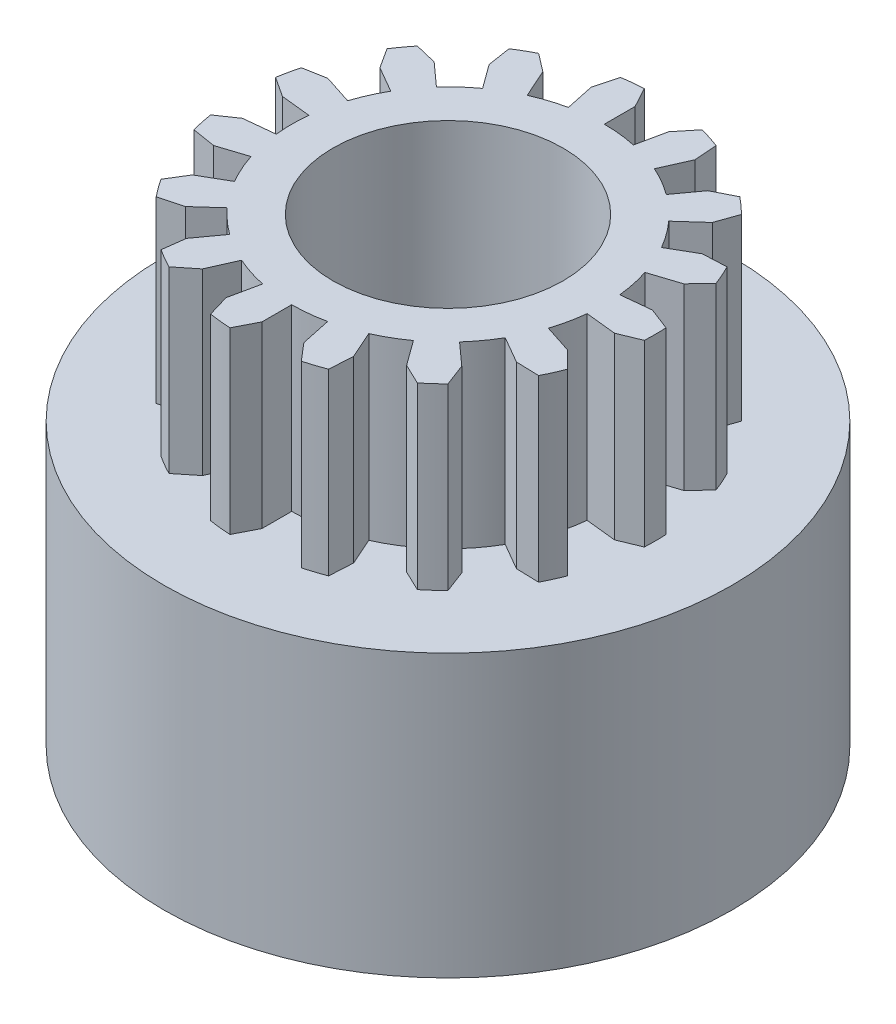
from build123d import *

# Parameters (mm, degrees)
SKETCH1_W           = 11.1125
SKETCH1_H           = 11
BOSS_EXTRUDE1_DEPTH = 7
HOLE1_D             = 9
HOLE1_CBORE_D       = 13
HOLE1_CBORE_DEPTH   = 3


with BuildPart() as part:
    # Sketch1 → Revolve1 (revolve)
    with BuildSketch(Plane.XY, mode=Mode.PRIVATE) as revolve1_sk:
        with Locations((5.55625, 5.5)):
            Rectangle(SKETCH1_W, SKETCH1_H)
    revolve(revolve1_sk.sketch.rotate(Axis((0, 11, 0), (0, -1, 0)), 270), axis=Axis((0, 11, 0), (0, -1, 0)))

    # Sketch2 → Boss-Extrude1 (add)
    with BuildSketch(Plane(origin=(0, 11, 0), x_dir=(-1, 0, 0), z_dir=(0, 1, 0))):
        with BuildLine():
            Line((-7.277131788, 0.764857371), (-6.079015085, 0.638930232))
            ThreePointArc((-6.079015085, 0.638930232), (-5.978927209, 1.27086021), (-5.813332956, 1.888866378))
            Line((-5.813332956, 1.888866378), (-6.91804243, 2.247808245))
            Line((-6.91804243, 2.247808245), (-7.57367121, 2.907259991))
            ThreePointArc((-7.57367121, 2.907259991), (-7.411137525, 3.299651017), (-7.228290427, 3.682997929))
            Line((-7.228290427, 3.682997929), (-6.33689517, 3.658608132))
            Line((-6.33689517, 3.658608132), (-5.293580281, 3.05625))
            ThreePointArc((-5.293580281, 3.05625), (-4.945116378, 3.592837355), (-4.542472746, 4.090060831))
            Line((-4.542472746, 4.090060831), (-5.405680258, 4.867296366))
            Line((-5.405680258, 4.867296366), (-5.736403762, 5.736403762))
            ThreePointArc((-5.736403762, 5.736403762), (-5.428322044, 6.028762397), (-5.105361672, 6.304596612))
            Line((-5.105361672, 6.304596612), (-4.300951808, 5.919752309))
            Line((-4.300951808, 5.919752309), (-3.592837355, 4.945116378))
            ThreePointArc((-3.592837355, 4.945116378), (-3.05625, 5.293580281), (-2.486177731, 5.58404661))
            Line((-2.486177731, 5.58404661), (-2.95862686, 6.645184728))
            Line((-2.95862686, 6.645184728), (-2.907259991, 7.57367121))
            ThreePointArc((-2.907259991, 7.57367121), (-2.506900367, 7.715445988), (-2.099669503, 7.836073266))
            Line((-2.099669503, 7.836073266), (-1.521334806, 7.157317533))
            Line((-1.521334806, 7.157317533), (-1.27086021, 5.978927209))
            ThreePointArc((-1.27086021, 5.978927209), (-0.638930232, 6.079015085), (0, 6.1125))
            Line((0, 6.1125), (0, 7.274060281))
            Line((0, 7.274060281), (0.424575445, 8.101382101))
            ThreePointArc((0.424575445, 8.101382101), (0.847987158, 8.068058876), (1.269074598, 8.012621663))
            Line((1.269074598, 8.012621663), (1.521334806, 7.157317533))
            Line((1.521334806, 7.157317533), (1.27086021, 5.978927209))
            ThreePointArc((1.27086021, 5.978927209), (1.888866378, 5.813332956), (2.486177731, 5.58404661))
            Line((2.486177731, 5.58404661), (2.95862686, 6.645184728))
            Line((2.95862686, 6.645184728), (3.682997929, 7.228290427))
            ThreePointArc((3.682997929, 7.228290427), (4.05625, 7.025631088), (4.418384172, 6.803714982))
            Line((4.418384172, 6.803714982), (4.300951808, 5.919752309))
            Line((4.300951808, 5.919752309), (3.592837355, 4.945116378))
            ThreePointArc((3.592837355, 4.945116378), (4.090060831, 4.542472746), (4.542472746, 4.090060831))
            Line((4.542472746, 4.090060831), (5.405680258, 4.867296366))
            Line((5.405680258, 4.867296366), (6.304596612, 5.105361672))
            ThreePointArc((6.304596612, 5.105361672), (6.563150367, 4.768407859), (6.803714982, 4.418384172))
            Line((6.803714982, 4.418384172), (6.33689517, 3.658608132))
            Line((6.33689517, 3.658608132), (5.293580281, 3.05625))
            ThreePointArc((5.293580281, 3.05625), (5.58404661, 2.486177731), (5.813332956, 1.888866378))
            Line((5.813332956, 1.888866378), (6.91804243, 2.247808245))
            Line((6.91804243, 2.247808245), (7.836073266, 2.099669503))
            ThreePointArc((7.836073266, 2.099669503), (7.935222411, 1.686683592), (8.012621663, 1.269074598))
            Line((8.012621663, 1.269074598), (7.277131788, 0.764857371))
            Line((7.277131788, 0.764857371), (6.079015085, 0.638930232))
            ThreePointArc((6.079015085, 0.638930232), (6.1125, 0), (6.079015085, -0.638930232))
            Line((6.079015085, -0.638930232), (7.234212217, -0.760346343))
            Line((7.234212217, -0.760346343), (8.012621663, -1.269074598))
            ThreePointArc((8.012621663, -1.269074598), (7.935222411, -1.686683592), (7.836073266, -2.099669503))
            Line((7.836073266, -2.099669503), (6.959086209, -2.261144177))
            Line((6.959086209, -2.261144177), (5.813332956, -1.888866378))
            ThreePointArc((5.813332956, -1.888866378), (5.58404661, -2.486177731), (5.293580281, -3.05625))
            Line((5.293580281, -3.05625), (6.299520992, -3.63703014))
            Line((6.299520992, -3.63703014), (6.803714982, -4.418384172))
            ThreePointArc((6.803714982, -4.418384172), (6.563150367, -4.768407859), (6.304596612, -5.105361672))
            Line((6.304596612, -5.105361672), (5.437751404, -4.896173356))
            Line((5.437751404, -4.896173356), (4.542472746, -4.090060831))
            ThreePointArc((4.542472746, -4.090060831), (4.090060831, -4.542472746), (3.592837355, -4.945116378))
            Line((3.592837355, -4.945116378), (4.275585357, -5.884838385))
            Line((4.275585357, -5.884838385), (4.418384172, -6.803714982))
            ThreePointArc((4.418384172, -6.803714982), (4.05625, -7.025631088), (3.682997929, -7.228290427))
            Line((3.682997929, -7.228290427), (2.97617998, -6.684609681))
            Line((2.97617998, -6.684609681), (2.486177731, -5.58404661))
            ThreePointArc((2.486177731, -5.58404661), (1.888866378, -5.813332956), (1.27086021, -5.978927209))
            Line((1.27086021, -5.978927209), (1.512362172, -7.115104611))
            Line((1.512362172, -7.115104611), (1.269074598, -8.012621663))
            ThreePointArc((1.269074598, -8.012621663), (0.847987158, -8.068058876), (0.424575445, -8.101382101))
            Line((0.424575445, -8.101382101), (0, -7.317216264))
            Line((0, -7.317216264), (0, -6.1125))
            ThreePointArc((0, -6.1125), (-0.638930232, -6.079015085), (-1.27086021, -5.978927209))
            Line((-1.27086021, -5.978927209), (-1.512362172, -7.115104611))
            Line((-1.512362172, -7.115104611), (-2.099669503, -7.836073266))
            ThreePointArc((-2.099669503, -7.836073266), (-2.506900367, -7.715445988), (-2.907259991, -7.57367121))
            Line((-2.907259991, -7.57367121), (-2.97617998, -6.684609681))
            Line((-2.97617998, -6.684609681), (-2.486177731, -5.58404661))
            ThreePointArc((-2.486177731, -5.58404661), (-3.05625, -5.293580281), (-3.592837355, -4.945116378))
            Line((-3.592837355, -4.945116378), (-4.275585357, -5.884838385))
            Line((-4.275585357, -5.884838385), (-5.105361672, -6.304596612))
            ThreePointArc((-5.105361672, -6.304596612), (-5.428322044, -6.028762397), (-5.736403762, -5.736403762))
            Line((-5.736403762, -5.736403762), (-5.437751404, -4.896173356))
            Line((-5.437751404, -4.896173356), (-4.542472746, -4.090060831))
            ThreePointArc((-4.542472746, -4.090060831), (-4.945116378, -3.592837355), (-5.293580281, -3.05625))
            Line((-5.293580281, -3.05625), (-6.299520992, -3.63703014))
            Line((-6.299520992, -3.63703014), (-7.228290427, -3.682997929))
            ThreePointArc((-7.228290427, -3.682997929), (-7.411137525, -3.299651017), (-7.57367121, -2.907259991))
            Line((-7.57367121, -2.907259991), (-6.959086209, -2.261144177))
            Line((-6.959086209, -2.261144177), (-5.813332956, -1.888866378))
            ThreePointArc((-5.813332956, -1.888866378), (-5.978927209, -1.27086021), (-6.079015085, -0.638930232))
            Line((-6.079015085, -0.638930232), (-7.234212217, -0.760346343))
            Line((-7.234212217, -0.760346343), (-8.101382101, -0.424575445))
            ThreePointArc((-8.101382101, -0.424575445), (-8.1125, 0), (-8.101382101, 0.424575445))
            Line((-8.101382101, 0.424575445), (-7.277131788, 0.764857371))
        make_face()
    extrude(amount=BOSS_EXTRUDE1_DEPTH)

    # Hole1 (through all)
    with Locations(Plane.XZ):
        with Locations((0, 0)):
            CounterBoreHole(HOLE1_D / 2, HOLE1_CBORE_D / 2, HOLE1_CBORE_DEPTH)


solid = part.part
